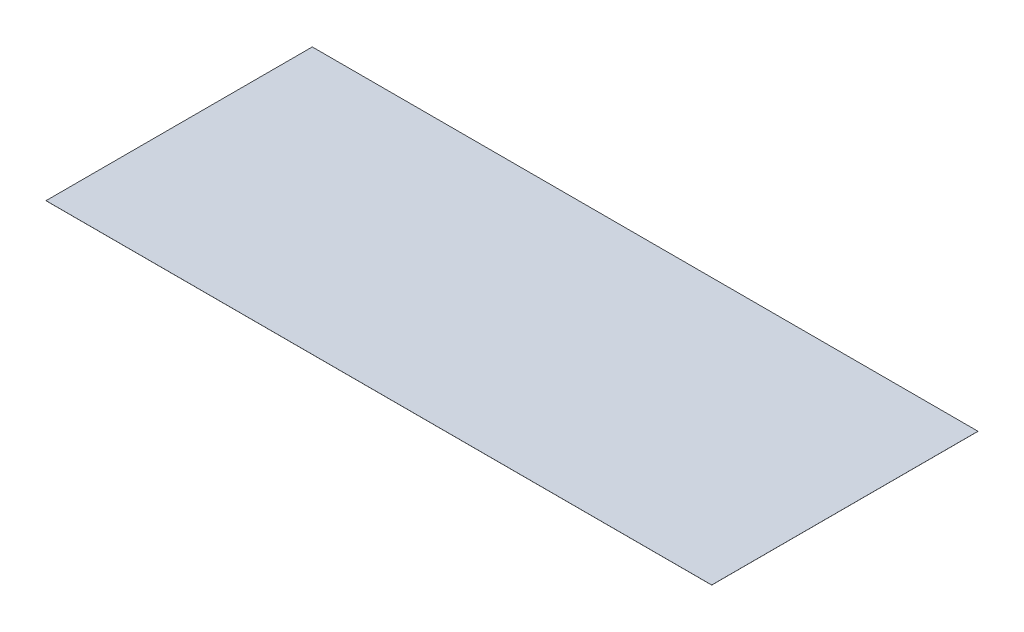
ISO-10303-21;
HEADER;
FILE_DESCRIPTION(('STEP AP214'),'2;1');
FILE_NAME('part.step','',(''),(''),'','','');
FILE_SCHEMA(('AUTOMOTIVE_DESIGN { 1 0 10303 214 1 1 1 1 }'));
ENDSEC;
DATA;
#1=APPLICATION_CONTEXT('core data for automotive mechanical design processes');
#2=APPLICATION_PROTOCOL_DEFINITION('international standard','automotive_design',2000,#1);
#3=PRODUCT_CONTEXT('',#1,'mechanical');
#4=PRODUCT('Part','Part','',(#3));
#5=PRODUCT_RELATED_PRODUCT_CATEGORY('part','',(#4));
#6=PRODUCT_DEFINITION_FORMATION('','',#4);
#7=PRODUCT_DEFINITION_CONTEXT('part definition',#1,'design');
#8=PRODUCT_DEFINITION('design','',#6,#7);
#9=PRODUCT_DEFINITION_SHAPE('','',#8);
#10=(LENGTH_UNIT() NAMED_UNIT(*) SI_UNIT(.MILLI.,.METRE.));
#11=(NAMED_UNIT(*) PLANE_ANGLE_UNIT() SI_UNIT($,.RADIAN.));
#12=(NAMED_UNIT(*) SI_UNIT($,.STERADIAN.) SOLID_ANGLE_UNIT());
#13=UNCERTAINTY_MEASURE_WITH_UNIT(LENGTH_MEASURE(1.E-05),#10,'distance_accuracy_value','');
#14=(GEOMETRIC_REPRESENTATION_CONTEXT(3) GLOBAL_UNCERTAINTY_ASSIGNED_CONTEXT((#13)) GLOBAL_UNIT_ASSIGNED_CONTEXT((#10,
#11,#12)) REPRESENTATION_CONTEXT('',''));
#15=CARTESIAN_POINT('',(0.,0.,0.));
#16=DIRECTION('',(0.,0.,1.));
#17=DIRECTION('',(1.,0.,0.));
#18=AXIS2_PLACEMENT_3D('',#15,#16,#17);
#19=CARTESIAN_POINT('',(-10000.,-1.,4000.));
#20=DIRECTION('',(0.,1.,0.));
#21=DIRECTION('',(0.,0.,1.));
#22=AXIS2_PLACEMENT_3D('',#19,#20,#21);
#23=PLANE('',#22);
#24=DIRECTION('',(1.,0.,0.));
#25=VECTOR('',#24,1.);
#26=CARTESIAN_POINT('',(-10000.,-1.,0.));
#27=LINE('',#26,#25);
#28=CARTESIAN_POINT('',(-10000.,-1.,0.));
#29=VERTEX_POINT('',#28);
#30=CARTESIAN_POINT('',(0.,-1.,0.));
#31=VERTEX_POINT('',#30);
#32=EDGE_CURVE('E96',#29,#31,#27,.T.);
#33=ORIENTED_EDGE('',*,*,#32,.T.);
#34=DIRECTION('',(0.,0.,-1.));
#35=VECTOR('',#34,1.);
#36=CARTESIAN_POINT('',(0.,-1.,4000.));
#37=LINE('',#36,#35);
#38=CARTESIAN_POINT('',(0.,-1.,4000.));
#39=VERTEX_POINT('',#38);
#40=EDGE_CURVE('E11',#39,#31,#37,.T.);
#41=ORIENTED_EDGE('',*,*,#40,.F.);
#42=DIRECTION('',(1.,0.,0.));
#43=VECTOR('',#42,1.);
#44=CARTESIAN_POINT('',(-10000.,-1.,4000.));
#45=LINE('',#44,#43);
#46=CARTESIAN_POINT('',(-10000.,-1.,4000.));
#47=VERTEX_POINT('',#46);
#48=EDGE_CURVE('E73',#47,#39,#45,.T.);
#49=ORIENTED_EDGE('',*,*,#48,.F.);
#50=DIRECTION('',(0.,0.,-1.));
#51=VECTOR('',#50,1.);
#52=CARTESIAN_POINT('',(-10000.,-1.,4000.));
#53=LINE('',#52,#51);
#54=EDGE_CURVE('E49',#47,#29,#53,.T.);
#55=ORIENTED_EDGE('',*,*,#54,.T.);
#56=EDGE_LOOP('',(#33,#41,#49,#55));
#57=FACE_BOUND('',#56,.T.);
#58=ADVANCED_FACE('F33',(#57),#23,.F.);
#59=CARTESIAN_POINT('',(0.,0.,4000.));
#60=DIRECTION('',(1.,0.,0.));
#61=DIRECTION('',(0.,0.,-1.));
#62=AXIS2_PLACEMENT_3D('',#59,#60,#61);
#63=PLANE('',#62);
#64=DIRECTION('',(0.,-1.,0.));
#65=VECTOR('',#64,1.);
#66=CARTESIAN_POINT('',(0.,0.,0.));
#67=LINE('',#66,#65);
#68=CARTESIAN_POINT('',(0.,0.,0.));
#69=VERTEX_POINT('',#68);
#70=EDGE_CURVE('E82',#69,#31,#67,.T.);
#71=ORIENTED_EDGE('',*,*,#70,.F.);
#72=DIRECTION('',(0.,0.,-1.));
#73=VECTOR('',#72,1.);
#74=CARTESIAN_POINT('',(0.,0.,4000.));
#75=LINE('',#74,#73);
#76=CARTESIAN_POINT('',(0.,0.,4000.));
#77=VERTEX_POINT('',#76);
#78=EDGE_CURVE('E41',#77,#69,#75,.T.);
#79=ORIENTED_EDGE('',*,*,#78,.F.);
#80=DIRECTION('',(0.,-1.,0.));
#81=VECTOR('',#80,1.);
#82=CARTESIAN_POINT('',(0.,0.,4000.));
#83=LINE('',#82,#81);
#84=EDGE_CURVE('E80',#77,#39,#83,.T.);
#85=ORIENTED_EDGE('',*,*,#84,.T.);
#86=ORIENTED_EDGE('',*,*,#40,.T.);
#87=EDGE_LOOP('',(#71,#79,#85,#86));
#88=FACE_BOUND('',#87,.T.);
#89=ADVANCED_FACE('F79',(#88),#63,.T.);
#90=CARTESIAN_POINT('',(-10000.,0.,4000.));
#91=DIRECTION('',(0.,1.,0.));
#92=DIRECTION('',(0.,0.,1.));
#93=AXIS2_PLACEMENT_3D('',#90,#91,#92);
#94=PLANE('',#93);
#95=DIRECTION('',(1.,0.,0.));
#96=VECTOR('',#95,1.);
#97=CARTESIAN_POINT('',(-10000.,0.,0.));
#98=LINE('',#97,#96);
#99=CARTESIAN_POINT('',(-10000.,0.,0.));
#100=VERTEX_POINT('',#99);
#101=EDGE_CURVE('E99',#100,#69,#98,.T.);
#102=ORIENTED_EDGE('',*,*,#101,.F.);
#103=DIRECTION('',(0.,0.,-1.));
#104=VECTOR('',#103,1.);
#105=CARTESIAN_POINT('',(-10000.,0.,4000.));
#106=LINE('',#105,#104);
#107=CARTESIAN_POINT('',(-10000.,0.,4000.));
#108=VERTEX_POINT('',#107);
#109=EDGE_CURVE('E62',#108,#100,#106,.T.);
#110=ORIENTED_EDGE('',*,*,#109,.F.);
#111=DIRECTION('',(1.,0.,0.));
#112=VECTOR('',#111,1.);
#113=CARTESIAN_POINT('',(-10000.,0.,4000.));
#114=LINE('',#113,#112);
#115=EDGE_CURVE('E88',#108,#77,#114,.T.);
#116=ORIENTED_EDGE('',*,*,#115,.T.);
#117=ORIENTED_EDGE('',*,*,#78,.T.);
#118=EDGE_LOOP('',(#102,#110,#116,#117));
#119=FACE_BOUND('',#118,.T.);
#120=ADVANCED_FACE('F90',(#119),#94,.T.);
#121=CARTESIAN_POINT('',(-10000.,-1.,4000.));
#122=DIRECTION('',(-1.,0.,0.));
#123=DIRECTION('',(0.,0.,1.));
#124=AXIS2_PLACEMENT_3D('',#121,#122,#123);
#125=PLANE('',#124);
#126=DIRECTION('',(0.,1.,0.));
#127=VECTOR('',#126,1.);
#128=CARTESIAN_POINT('',(-10000.,-1.,0.));
#129=LINE('',#128,#127);
#130=EDGE_CURVE('E101',#29,#100,#129,.T.);
#131=ORIENTED_EDGE('',*,*,#130,.F.);
#132=ORIENTED_EDGE('',*,*,#54,.F.);
#133=DIRECTION('',(0.,1.,0.));
#134=VECTOR('',#133,1.);
#135=CARTESIAN_POINT('',(-10000.,-1.,4000.));
#136=LINE('',#135,#134);
#137=EDGE_CURVE('E91',#47,#108,#136,.T.);
#138=ORIENTED_EDGE('',*,*,#137,.T.);
#139=ORIENTED_EDGE('',*,*,#109,.T.);
#140=EDGE_LOOP('',(#131,#132,#138,#139));
#141=FACE_BOUND('',#140,.T.);
#142=ADVANCED_FACE('F107',(#141),#125,.T.);
#143=CARTESIAN_POINT('',(0.,0.,4000.));
#144=DIRECTION('',(0.,0.,-1.));
#145=DIRECTION('',(-1.,0.,0.));
#146=AXIS2_PLACEMENT_3D('',#143,#144,#145);
#147=PLANE('',#146);
#148=ORIENTED_EDGE('',*,*,#48,.T.);
#149=ORIENTED_EDGE('',*,*,#84,.F.);
#150=ORIENTED_EDGE('',*,*,#115,.F.);
#151=ORIENTED_EDGE('',*,*,#137,.F.);
#152=EDGE_LOOP('',(#148,#149,#150,#151));
#153=FACE_BOUND('',#152,.T.);
#154=ADVANCED_FACE('F87',(#153),#147,.F.);
#155=CARTESIAN_POINT('',(0.,0.,0.));
#156=DIRECTION('',(0.,0.,-1.));
#157=DIRECTION('',(-1.,0.,0.));
#158=AXIS2_PLACEMENT_3D('',#155,#156,#157);
#159=PLANE('',#158);
#160=ORIENTED_EDGE('',*,*,#32,.F.);
#161=ORIENTED_EDGE('',*,*,#130,.T.);
#162=ORIENTED_EDGE('',*,*,#101,.T.);
#163=ORIENTED_EDGE('',*,*,#70,.T.);
#164=EDGE_LOOP('',(#160,#161,#162,#163));
#165=FACE_BOUND('',#164,.T.);
#166=ADVANCED_FACE('F106',(#165),#159,.T.);
#167=CLOSED_SHELL('',(#58,#89,#120,#142,#154,#166));
#168=MANIFOLD_SOLID_BREP('B2',#167);
#169=ADVANCED_BREP_SHAPE_REPRESENTATION('',(#18,#168),#14);
#170=SHAPE_DEFINITION_REPRESENTATION(#9,#169);
ENDSEC;
END-ISO-10303-21;
